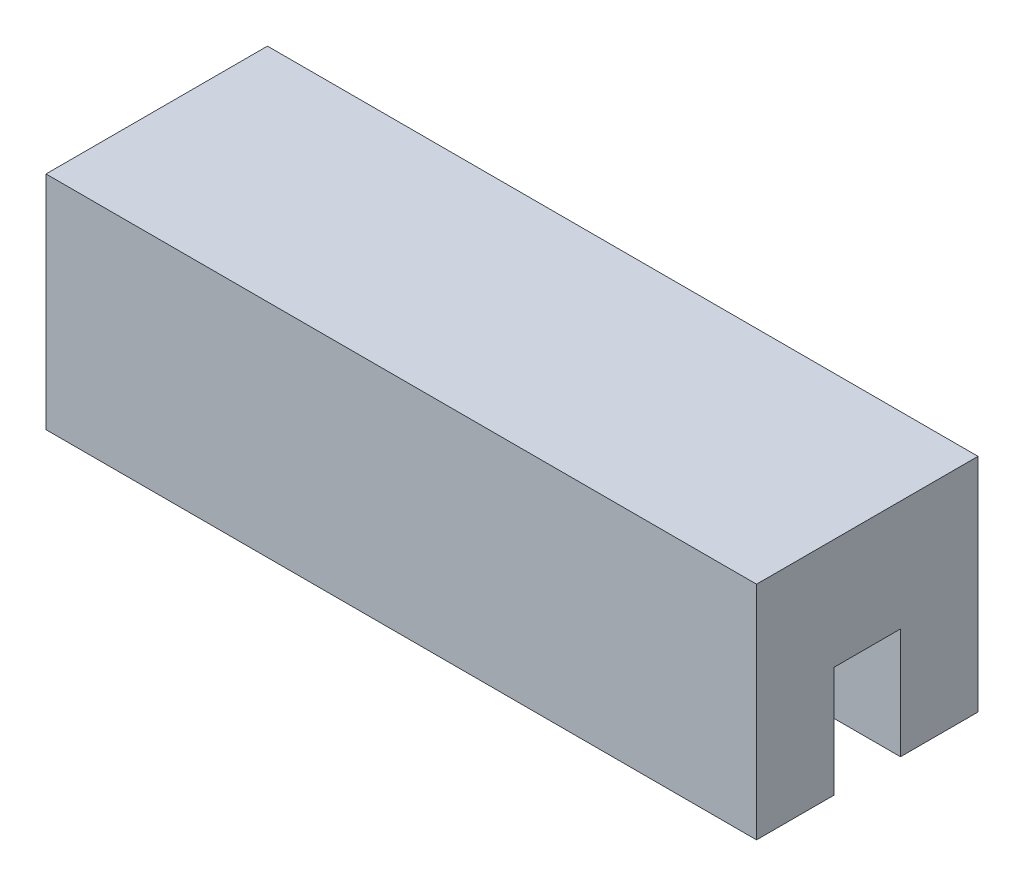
ISO-10303-21;
HEADER;
FILE_DESCRIPTION(('STEP AP214'),'2;1');
FILE_NAME('part.step','',(''),(''),'','','');
FILE_SCHEMA(('AUTOMOTIVE_DESIGN { 1 0 10303 214 1 1 1 1 }'));
ENDSEC;
DATA;
#1=APPLICATION_CONTEXT('core data for automotive mechanical design processes');
#2=APPLICATION_PROTOCOL_DEFINITION('international standard','automotive_design',2000,#1);
#3=PRODUCT_CONTEXT('',#1,'mechanical');
#4=PRODUCT('Part','Part','',(#3));
#5=PRODUCT_RELATED_PRODUCT_CATEGORY('part','',(#4));
#6=PRODUCT_DEFINITION_FORMATION('','',#4);
#7=PRODUCT_DEFINITION_CONTEXT('part definition',#1,'design');
#8=PRODUCT_DEFINITION('design','',#6,#7);
#9=PRODUCT_DEFINITION_SHAPE('','',#8);
#10=(LENGTH_UNIT() NAMED_UNIT(*) SI_UNIT(.MILLI.,.METRE.));
#11=(NAMED_UNIT(*) PLANE_ANGLE_UNIT() SI_UNIT($,.RADIAN.));
#12=(NAMED_UNIT(*) SI_UNIT($,.STERADIAN.) SOLID_ANGLE_UNIT());
#13=UNCERTAINTY_MEASURE_WITH_UNIT(LENGTH_MEASURE(1.E-05),#10,'distance_accuracy_value','');
#14=(GEOMETRIC_REPRESENTATION_CONTEXT(3) GLOBAL_UNCERTAINTY_ASSIGNED_CONTEXT((#13)) GLOBAL_UNIT_ASSIGNED_CONTEXT((#10,
#11,#12)) REPRESENTATION_CONTEXT('',''));
#15=CARTESIAN_POINT('',(0.,0.,0.));
#16=DIRECTION('',(0.,0.,1.));
#17=DIRECTION('',(1.,0.,0.));
#18=AXIS2_PLACEMENT_3D('',#15,#16,#17);
#19=CARTESIAN_POINT('',(-12.5283678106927,0.,-3.6));
#20=DIRECTION('',(0.,0.,-1.));
#21=DIRECTION('',(0.,1.,0.));
#22=AXIS2_PLACEMENT_3D('',#19,#20,#21);
#23=PLANE('',#22);
#24=CARTESIAN_POINT('',(22.5,-6.,-3.6));
#25=DIRECTION('',(0.,0.,-1.));
#26=DIRECTION('',(0.,1.,0.));
#27=AXIS2_PLACEMENT_3D('',#24,#25,#26);
#28=CIRCLE('',#27,4.50000000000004);
#29=CARTESIAN_POINT('',(22.5,-1.49999999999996,-3.6));
#30=VERTEX_POINT('',#29);
#31=EDGE_CURVE('E224',#30,#30,#28,.T.);
#32=ORIENTED_EDGE('',*,*,#31,.T.);
#33=EDGE_LOOP('',(#32));
#34=FACE_BOUND('',#33,.T.);
#35=DIRECTION('',(1.,0.,0.));
#36=VECTOR('',#35,1.);
#37=CARTESIAN_POINT('',(-12.5283678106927,0.,-3.6));
#38=LINE('',#37,#36);
#39=CARTESIAN_POINT('',(40.6403124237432,0.,-3.6));
#40=VERTEX_POINT('',#39);
#41=CARTESIAN_POINT('',(77.,0.,-3.6));
#42=VERTEX_POINT('',#41);
#43=EDGE_CURVE('E138',#40,#42,#38,.T.);
#44=ORIENTED_EDGE('',*,*,#43,.F.);
#45=CARTESIAN_POINT('',(40.,1.99999999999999,-3.6));
#46=DIRECTION('',(0.,0.,-1.));
#47=DIRECTION('',(0.,1.,0.));
#48=AXIS2_PLACEMENT_3D('',#45,#46,#47);
#49=CIRCLE('',#48,2.09999999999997);
#50=CARTESIAN_POINT('',(39.3596875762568,0.,-3.6));
#51=VERTEX_POINT('',#50);
#52=EDGE_CURVE('E131',#40,#51,#49,.T.);
#53=ORIENTED_EDGE('',*,*,#52,.T.);
#54=CARTESIAN_POINT('',(5.64031242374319,0.,-3.6));
#55=VERTEX_POINT('',#54);
#56=EDGE_CURVE('E129',#55,#51,#38,.T.);
#57=ORIENTED_EDGE('',*,*,#56,.F.);
#58=CARTESIAN_POINT('',(5.,2.,-3.6));
#59=DIRECTION('',(0.,0.,-1.));
#60=DIRECTION('',(0.,1.,0.));
#61=AXIS2_PLACEMENT_3D('',#58,#59,#60);
#62=CIRCLE('',#61,2.09999999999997);
#63=CARTESIAN_POINT('',(4.35968757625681,0.,-3.6));
#64=VERTEX_POINT('',#63);
#65=EDGE_CURVE('E119',#55,#64,#62,.T.);
#66=ORIENTED_EDGE('',*,*,#65,.T.);
#67=CARTESIAN_POINT('',(0.,0.,-3.6));
#68=VERTEX_POINT('',#67);
#69=EDGE_CURVE('E140',#68,#64,#38,.T.);
#70=ORIENTED_EDGE('',*,*,#69,.F.);
#71=DIRECTION('',(0.,-1.,0.));
#72=VECTOR('',#71,1.);
#73=CARTESIAN_POINT('',(0.,0.,-3.6));
#74=LINE('',#73,#72);
#75=CARTESIAN_POINT('',(0.,-12.,-3.6));
#76=VERTEX_POINT('',#75);
#77=EDGE_CURVE('E137',#68,#76,#74,.T.);
#78=ORIENTED_EDGE('',*,*,#77,.T.);
#79=DIRECTION('',(1.,0.,0.));
#80=VECTOR('',#79,1.);
#81=CARTESIAN_POINT('',(-12.5283678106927,-12.,-3.6));
#82=LINE('',#81,#80);
#83=CARTESIAN_POINT('',(77.,-12.,-3.6));
#84=VERTEX_POINT('',#83);
#85=EDGE_CURVE('E145',#76,#84,#82,.T.);
#86=ORIENTED_EDGE('',*,*,#85,.T.);
#87=DIRECTION('',(0.,1.,0.));
#88=VECTOR('',#87,1.);
#89=CARTESIAN_POINT('',(77.,0.,-3.6));
#90=LINE('',#89,#88);
#91=EDGE_CURVE('E215',#84,#42,#90,.T.);
#92=ORIENTED_EDGE('',*,*,#91,.T.);
#93=EDGE_LOOP('',(#44,#53,#57,#66,#70,#78,#86,#92));
#94=FACE_BOUND('',#93,.T.);
#95=ADVANCED_FACE('F39',(#34,#94),#23,.F.);
#96=CARTESIAN_POINT('',(77.,0.,0.));
#97=DIRECTION('',(1.,0.,0.));
#98=DIRECTION('',(0.,0.,-1.));
#99=AXIS2_PLACEMENT_3D('',#96,#97,#98);
#100=PLANE('',#99);
#101=DIRECTION('',(0.,1.,0.));
#102=VECTOR('',#101,1.);
#103=CARTESIAN_POINT('',(77.,0.,3.6));
#104=LINE('',#103,#102);
#105=CARTESIAN_POINT('',(77.,-12.,3.6));
#106=VERTEX_POINT('',#105);
#107=CARTESIAN_POINT('',(77.,0.,3.6));
#108=VERTEX_POINT('',#107);
#109=EDGE_CURVE('E196',#106,#108,#104,.T.);
#110=ORIENTED_EDGE('',*,*,#109,.T.);
#111=DIRECTION('',(0.,0.,1.));
#112=VECTOR('',#111,1.);
#113=CARTESIAN_POINT('',(77.,0.,0.));
#114=LINE('',#113,#112);
#115=EDGE_CURVE('E142',#42,#108,#114,.T.);
#116=ORIENTED_EDGE('',*,*,#115,.F.);
#117=ORIENTED_EDGE('',*,*,#91,.F.);
#118=DIRECTION('',(0.,0.,-1.));
#119=VECTOR('',#118,1.);
#120=CARTESIAN_POINT('',(77.,-12.,12.));
#121=LINE('',#120,#119);
#122=CARTESIAN_POINT('',(77.,-12.,-12.));
#123=VERTEX_POINT('',#122);
#124=EDGE_CURVE('E152',#84,#123,#121,.T.);
#125=ORIENTED_EDGE('',*,*,#124,.T.);
#126=DIRECTION('',(0.,1.,0.));
#127=VECTOR('',#126,1.);
#128=CARTESIAN_POINT('',(77.,12.,-12.));
#129=LINE('',#128,#127);
#130=CARTESIAN_POINT('',(77.,12.,-12.));
#131=VERTEX_POINT('',#130);
#132=EDGE_CURVE('E148',#123,#131,#129,.T.);
#133=ORIENTED_EDGE('',*,*,#132,.T.);
#134=DIRECTION('',(0.,0.,1.));
#135=VECTOR('',#134,1.);
#136=CARTESIAN_POINT('',(77.,12.,12.));
#137=LINE('',#136,#135);
#138=CARTESIAN_POINT('',(77.,12.,12.));
#139=VERTEX_POINT('',#138);
#140=EDGE_CURVE('E149',#131,#139,#137,.T.);
#141=ORIENTED_EDGE('',*,*,#140,.T.);
#142=DIRECTION('',(0.,-1.,0.));
#143=VECTOR('',#142,1.);
#144=CARTESIAN_POINT('',(77.,12.,12.));
#145=LINE('',#144,#143);
#146=CARTESIAN_POINT('',(77.,-12.,12.));
#147=VERTEX_POINT('',#146);
#148=EDGE_CURVE('E155',#139,#147,#145,.T.);
#149=ORIENTED_EDGE('',*,*,#148,.T.);
#150=EDGE_CURVE('E154',#147,#106,#121,.T.);
#151=ORIENTED_EDGE('',*,*,#150,.T.);
#152=EDGE_LOOP('',(#110,#116,#117,#125,#133,#141,#149,#151));
#153=FACE_BOUND('',#152,.T.);
#154=ADVANCED_FACE('F198',(#153),#100,.T.);
#155=CARTESIAN_POINT('',(77.,-12.,12.));
#156=DIRECTION('',(0.,1.,0.));
#157=DIRECTION('',(0.,0.,1.));
#158=AXIS2_PLACEMENT_3D('',#155,#156,#157);
#159=PLANE('',#158);
#160=ORIENTED_EDGE('',*,*,#85,.F.);
#161=DIRECTION('',(0.,0.,-1.));
#162=VECTOR('',#161,1.);
#163=CARTESIAN_POINT('',(0.,-12.,12.));
#164=LINE('',#163,#162);
#165=CARTESIAN_POINT('',(0.,-12.,-12.));
#166=VERTEX_POINT('',#165);
#167=EDGE_CURVE('E170',#76,#166,#164,.T.);
#168=ORIENTED_EDGE('',*,*,#167,.T.);
#169=DIRECTION('',(-1.,0.,0.));
#170=VECTOR('',#169,1.);
#171=CARTESIAN_POINT('',(77.,-12.,-12.));
#172=LINE('',#171,#170);
#173=EDGE_CURVE('E158',#123,#166,#172,.T.);
#174=ORIENTED_EDGE('',*,*,#173,.F.);
#175=ORIENTED_EDGE('',*,*,#124,.F.);
#176=EDGE_LOOP('',(#160,#168,#174,#175));
#177=FACE_BOUND('',#176,.T.);
#178=ADVANCED_FACE('F208',(#177),#159,.F.);
#179=CARTESIAN_POINT('',(0.,0.,0.));
#180=DIRECTION('',(1.,0.,0.));
#181=DIRECTION('',(0.,0.,-1.));
#182=AXIS2_PLACEMENT_3D('',#179,#180,#181);
#183=PLANE('',#182);
#184=DIRECTION('',(0.,0.,-1.));
#185=VECTOR('',#184,1.);
#186=CARTESIAN_POINT('',(0.,0.,0.));
#187=LINE('',#186,#185);
#188=CARTESIAN_POINT('',(0.,0.,3.6));
#189=VERTEX_POINT('',#188);
#190=EDGE_CURVE('E162',#189,#68,#187,.T.);
#191=ORIENTED_EDGE('',*,*,#190,.F.);
#192=DIRECTION('',(0.,-1.,0.));
#193=VECTOR('',#192,1.);
#194=CARTESIAN_POINT('',(0.,0.,3.6));
#195=LINE('',#194,#193);
#196=CARTESIAN_POINT('',(0.,-12.,3.6));
#197=VERTEX_POINT('',#196);
#198=EDGE_CURVE('E189',#189,#197,#195,.T.);
#199=ORIENTED_EDGE('',*,*,#198,.T.);
#200=CARTESIAN_POINT('',(0.,-12.,12.));
#201=VERTEX_POINT('',#200);
#202=EDGE_CURVE('E147',#201,#197,#164,.T.);
#203=ORIENTED_EDGE('',*,*,#202,.F.);
#204=DIRECTION('',(0.,-1.,0.));
#205=VECTOR('',#204,1.);
#206=CARTESIAN_POINT('',(0.,12.,12.));
#207=LINE('',#206,#205);
#208=CARTESIAN_POINT('',(0.,12.,12.));
#209=VERTEX_POINT('',#208);
#210=EDGE_CURVE('E164',#209,#201,#207,.T.);
#211=ORIENTED_EDGE('',*,*,#210,.F.);
#212=DIRECTION('',(0.,0.,1.));
#213=VECTOR('',#212,1.);
#214=CARTESIAN_POINT('',(0.,12.,12.));
#215=LINE('',#214,#213);
#216=CARTESIAN_POINT('',(0.,12.,-12.));
#217=VERTEX_POINT('',#216);
#218=EDGE_CURVE('E165',#217,#209,#215,.T.);
#219=ORIENTED_EDGE('',*,*,#218,.F.);
#220=DIRECTION('',(0.,1.,0.));
#221=VECTOR('',#220,1.);
#222=CARTESIAN_POINT('',(0.,12.,-12.));
#223=LINE('',#222,#221);
#224=EDGE_CURVE('E157',#166,#217,#223,.T.);
#225=ORIENTED_EDGE('',*,*,#224,.F.);
#226=ORIENTED_EDGE('',*,*,#167,.F.);
#227=ORIENTED_EDGE('',*,*,#77,.F.);
#228=EDGE_LOOP('',(#191,#199,#203,#211,#219,#225,#226,#227));
#229=FACE_BOUND('',#228,.T.);
#230=ADVANCED_FACE('F184',(#229),#183,.F.);
#231=CARTESIAN_POINT('',(77.,12.,-12.));
#232=DIRECTION('',(0.,0.,1.));
#233=DIRECTION('',(0.,-1.,0.));
#234=AXIS2_PLACEMENT_3D('',#231,#232,#233);
#235=PLANE('',#234);
#236=CARTESIAN_POINT('',(40.,1.99999999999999,-12.));
#237=DIRECTION('',(0.,0.,1.));
#238=DIRECTION('',(1.,0.,0.));
#239=AXIS2_PLACEMENT_3D('',#236,#237,#238);
#240=CIRCLE('',#239,2.09999999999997);
#241=CARTESIAN_POINT('',(42.1,1.99999999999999,-12.));
#242=VERTEX_POINT('',#241);
#243=EDGE_CURVE('E229',#242,#242,#240,.T.);
#244=ORIENTED_EDGE('',*,*,#243,.T.);
#245=EDGE_LOOP('',(#244));
#246=FACE_BOUND('',#245,.T.);
#247=CARTESIAN_POINT('',(22.5,-6.,-12.));
#248=DIRECTION('',(0.,0.,1.));
#249=DIRECTION('',(1.,0.,0.));
#250=AXIS2_PLACEMENT_3D('',#247,#248,#249);
#251=CIRCLE('',#250,4.50000000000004);
#252=CARTESIAN_POINT('',(27.,-6.,-12.));
#253=VERTEX_POINT('',#252);
#254=EDGE_CURVE('E223',#253,#253,#251,.T.);
#255=ORIENTED_EDGE('',*,*,#254,.T.);
#256=EDGE_LOOP('',(#255));
#257=FACE_BOUND('',#256,.T.);
#258=CARTESIAN_POINT('',(5.,2.,-12.));
#259=DIRECTION('',(0.,0.,1.));
#260=DIRECTION('',(1.,0.,0.));
#261=AXIS2_PLACEMENT_3D('',#258,#259,#260);
#262=CIRCLE('',#261,2.09999999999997);
#263=CARTESIAN_POINT('',(7.09999999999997,2.,-12.));
#264=VERTEX_POINT('',#263);
#265=EDGE_CURVE('E127',#264,#264,#262,.T.);
#266=ORIENTED_EDGE('',*,*,#265,.T.);
#267=EDGE_LOOP('',(#266));
#268=FACE_BOUND('',#267,.T.);
#269=ORIENTED_EDGE('',*,*,#224,.T.);
#270=DIRECTION('',(-1.,0.,0.));
#271=VECTOR('',#270,1.);
#272=CARTESIAN_POINT('',(77.,12.,-12.));
#273=LINE('',#272,#271);
#274=EDGE_CURVE('E11',#131,#217,#273,.T.);
#275=ORIENTED_EDGE('',*,*,#274,.F.);
#276=ORIENTED_EDGE('',*,*,#132,.F.);
#277=ORIENTED_EDGE('',*,*,#173,.T.);
#278=EDGE_LOOP('',(#269,#275,#276,#277));
#279=FACE_BOUND('',#278,.T.);
#280=ADVANCED_FACE('F41',(#246,#257,#268,#279),#235,.F.);
#281=CARTESIAN_POINT('',(77.,12.,12.));
#282=DIRECTION('',(0.,-1.,0.));
#283=DIRECTION('',(0.,0.,-1.));
#284=AXIS2_PLACEMENT_3D('',#281,#282,#283);
#285=PLANE('',#284);
#286=ORIENTED_EDGE('',*,*,#218,.T.);
#287=DIRECTION('',(-1.,0.,0.));
#288=VECTOR('',#287,1.);
#289=CARTESIAN_POINT('',(77.,12.,12.));
#290=LINE('',#289,#288);
#291=EDGE_CURVE('E50',#139,#209,#290,.T.);
#292=ORIENTED_EDGE('',*,*,#291,.F.);
#293=ORIENTED_EDGE('',*,*,#140,.F.);
#294=ORIENTED_EDGE('',*,*,#274,.T.);
#295=EDGE_LOOP('',(#286,#292,#293,#294));
#296=FACE_BOUND('',#295,.T.);
#297=ADVANCED_FACE('F203',(#296),#285,.F.);
#298=CARTESIAN_POINT('',(77.,12.,12.));
#299=DIRECTION('',(0.,0.,-1.));
#300=DIRECTION('',(0.,1.,0.));
#301=AXIS2_PLACEMENT_3D('',#298,#299,#300);
#302=PLANE('',#301);
#303=ORIENTED_EDGE('',*,*,#210,.T.);
#304=DIRECTION('',(-1.,0.,0.));
#305=VECTOR('',#304,1.);
#306=CARTESIAN_POINT('',(77.,-12.,12.));
#307=LINE('',#306,#305);
#308=EDGE_CURVE('E172',#147,#201,#307,.T.);
#309=ORIENTED_EDGE('',*,*,#308,.F.);
#310=ORIENTED_EDGE('',*,*,#148,.F.);
#311=ORIENTED_EDGE('',*,*,#291,.T.);
#312=EDGE_LOOP('',(#303,#309,#310,#311));
#313=FACE_BOUND('',#312,.T.);
#314=ADVANCED_FACE('F178',(#313),#302,.F.);
#315=ORIENTED_EDGE('',*,*,#202,.T.);
#316=DIRECTION('',(1.,0.,0.));
#317=VECTOR('',#316,1.);
#318=CARTESIAN_POINT('',(-12.5283678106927,-12.,3.6));
#319=LINE('',#318,#317);
#320=EDGE_CURVE('E192',#197,#106,#319,.T.);
#321=ORIENTED_EDGE('',*,*,#320,.T.);
#322=ORIENTED_EDGE('',*,*,#150,.F.);
#323=ORIENTED_EDGE('',*,*,#308,.T.);
#324=EDGE_LOOP('',(#315,#321,#322,#323));
#325=FACE_BOUND('',#324,.T.);
#326=ADVANCED_FACE('F191',(#325),#159,.F.);
#327=CARTESIAN_POINT('',(-12.5283678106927,0.,0.));
#328=DIRECTION('',(0.,1.,0.));
#329=DIRECTION('',(0.,0.,1.));
#330=AXIS2_PLACEMENT_3D('',#327,#328,#329);
#331=PLANE('',#330);
#332=ORIENTED_EDGE('',*,*,#190,.T.);
#333=ORIENTED_EDGE('',*,*,#69,.T.);
#334=EDGE_CURVE('E116',#64,#55,#38,.T.);
#335=ORIENTED_EDGE('',*,*,#334,.T.);
#336=ORIENTED_EDGE('',*,*,#56,.T.);
#337=EDGE_CURVE('E133',#51,#40,#38,.T.);
#338=ORIENTED_EDGE('',*,*,#337,.T.);
#339=ORIENTED_EDGE('',*,*,#43,.T.);
#340=ORIENTED_EDGE('',*,*,#115,.T.);
#341=DIRECTION('',(1.,0.,0.));
#342=VECTOR('',#341,1.);
#343=CARTESIAN_POINT('',(-12.5283678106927,0.,3.6));
#344=LINE('',#343,#342);
#345=EDGE_CURVE('E220',#189,#108,#344,.T.);
#346=ORIENTED_EDGE('',*,*,#345,.F.);
#347=EDGE_LOOP('',(#332,#333,#335,#336,#338,#339,#340,#346));
#348=FACE_BOUND('',#347,.T.);
#349=ADVANCED_FACE('F136',(#348),#331,.F.);
#350=CARTESIAN_POINT('',(-12.5283678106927,0.,3.6));
#351=DIRECTION('',(0.,0.,-1.));
#352=DIRECTION('',(0.,1.,0.));
#353=AXIS2_PLACEMENT_3D('',#350,#351,#352);
#354=PLANE('',#353);
#355=ORIENTED_EDGE('',*,*,#345,.T.);
#356=ORIENTED_EDGE('',*,*,#109,.F.);
#357=ORIENTED_EDGE('',*,*,#320,.F.);
#358=ORIENTED_EDGE('',*,*,#198,.F.);
#359=EDGE_LOOP('',(#355,#356,#357,#358));
#360=FACE_BOUND('',#359,.T.);
#361=ADVANCED_FACE('F241',(#360),#354,.T.);
#362=CARTESIAN_POINT('',(22.5,-6.,9.12792206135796));
#363=DIRECTION('',(0.,0.,-1.));
#364=DIRECTION('',(-1.,0.,0.));
#365=AXIS2_PLACEMENT_3D('',#362,#363,#364);
#366=CYLINDRICAL_SURFACE('',#365,4.50000000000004);
#367=ORIENTED_EDGE('',*,*,#31,.F.);
#368=EDGE_LOOP('',(#367));
#369=FACE_BOUND('',#368,.T.);
#370=ORIENTED_EDGE('',*,*,#254,.F.);
#371=EDGE_LOOP('',(#370));
#372=FACE_BOUND('',#371,.T.);
#373=ADVANCED_FACE('F244',(#369,#372),#366,.F.);
#374=CARTESIAN_POINT('',(5.,2.,9.12792206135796));
#375=DIRECTION('',(0.,0.,-1.));
#376=DIRECTION('',(-1.,0.,0.));
#377=AXIS2_PLACEMENT_3D('',#374,#375,#376);
#378=CYLINDRICAL_SURFACE('',#377,2.09999999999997);
#379=ORIENTED_EDGE('',*,*,#65,.F.);
#380=EDGE_CURVE('E58',#64,#55,#62,.T.);
#381=ORIENTED_EDGE('',*,*,#380,.F.);
#382=EDGE_LOOP('',(#379,#381));
#383=FACE_BOUND('',#382,.T.);
#384=ORIENTED_EDGE('',*,*,#265,.F.);
#385=EDGE_LOOP('',(#384));
#386=FACE_BOUND('',#385,.T.);
#387=ADVANCED_FACE('F121',(#383,#386),#378,.F.);
#388=CARTESIAN_POINT('',(-12.5283678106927,0.,-3.6));
#389=DIRECTION('',(0.,0.,-1.));
#390=DIRECTION('',(0.,1.,0.));
#391=AXIS2_PLACEMENT_3D('',#388,#389,#390);
#392=PLANE('',#391);
#393=ORIENTED_EDGE('',*,*,#380,.T.);
#394=ORIENTED_EDGE('',*,*,#334,.F.);
#395=EDGE_LOOP('',(#393,#394));
#396=FACE_BOUND('',#395,.T.);
#397=ADVANCED_FACE('F111',(#396),#392,.T.);
#398=CARTESIAN_POINT('',(40.,1.99999999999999,9.12792206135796));
#399=DIRECTION('',(0.,0.,-1.));
#400=DIRECTION('',(-1.,0.,0.));
#401=AXIS2_PLACEMENT_3D('',#398,#399,#400);
#402=CYLINDRICAL_SURFACE('',#401,2.09999999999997);
#403=ORIENTED_EDGE('',*,*,#52,.F.);
#404=EDGE_CURVE('E52',#51,#40,#49,.T.);
#405=ORIENTED_EDGE('',*,*,#404,.F.);
#406=EDGE_LOOP('',(#403,#405));
#407=FACE_BOUND('',#406,.T.);
#408=ORIENTED_EDGE('',*,*,#243,.F.);
#409=EDGE_LOOP('',(#408));
#410=FACE_BOUND('',#409,.T.);
#411=ADVANCED_FACE('F240',(#407,#410),#402,.F.);
#412=CARTESIAN_POINT('',(-12.5283678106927,0.,-3.6));
#413=DIRECTION('',(0.,0.,-1.));
#414=DIRECTION('',(0.,1.,0.));
#415=AXIS2_PLACEMENT_3D('',#412,#413,#414);
#416=PLANE('',#415);
#417=ORIENTED_EDGE('',*,*,#404,.T.);
#418=ORIENTED_EDGE('',*,*,#337,.F.);
#419=EDGE_LOOP('',(#417,#418));
#420=FACE_BOUND('',#419,.T.);
#421=ADVANCED_FACE('F237',(#420),#416,.T.);
#422=CLOSED_SHELL('',(#95,#154,#178,#230,#280,#297,#314,#326,#349,#361,#373,#387,#397,#411,#421));
#423=MANIFOLD_SOLID_BREP('B2',#422);
#424=ADVANCED_BREP_SHAPE_REPRESENTATION('',(#18,#423),#14);
#425=SHAPE_DEFINITION_REPRESENTATION(#9,#424);
ENDSEC;
END-ISO-10303-21;
